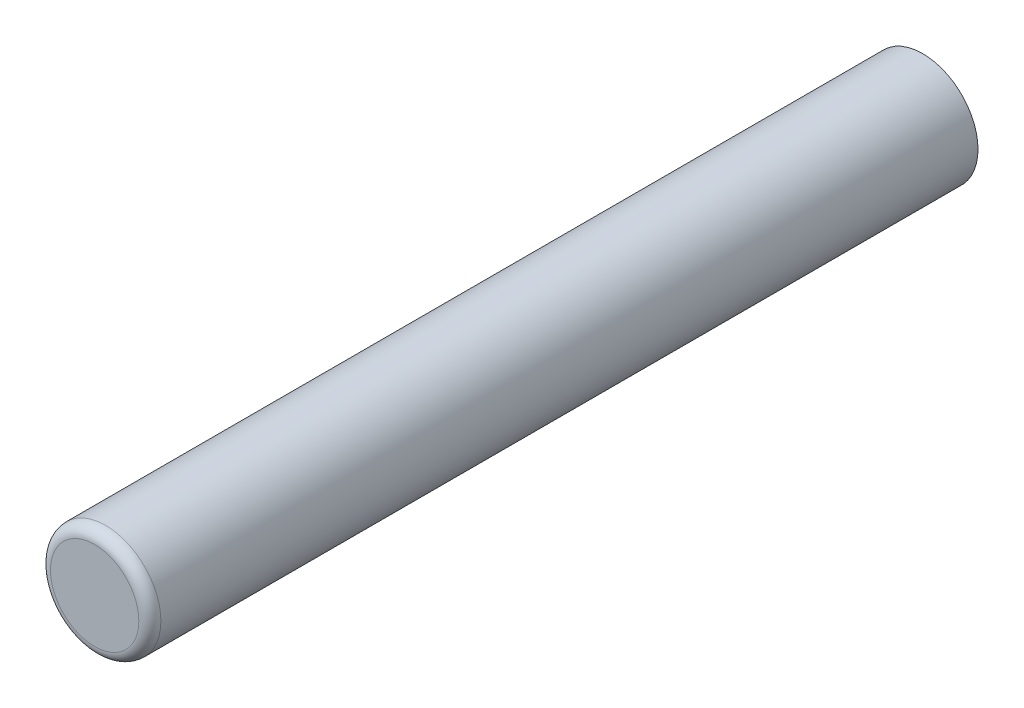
ISO-10303-21;
HEADER;
FILE_DESCRIPTION(('STEP AP214'),'2;1');
FILE_NAME('part.step','',(''),(''),'','','');
FILE_SCHEMA(('AUTOMOTIVE_DESIGN { 1 0 10303 214 1 1 1 1 }'));
ENDSEC;
DATA;
#1=APPLICATION_CONTEXT('core data for automotive mechanical design processes');
#2=APPLICATION_PROTOCOL_DEFINITION('international standard','automotive_design',2000,#1);
#3=PRODUCT_CONTEXT('',#1,'mechanical');
#4=PRODUCT('Part','Part','',(#3));
#5=PRODUCT_RELATED_PRODUCT_CATEGORY('part','',(#4));
#6=PRODUCT_DEFINITION_FORMATION('','',#4);
#7=PRODUCT_DEFINITION_CONTEXT('part definition',#1,'design');
#8=PRODUCT_DEFINITION('design','',#6,#7);
#9=PRODUCT_DEFINITION_SHAPE('','',#8);
#10=(LENGTH_UNIT() NAMED_UNIT(*) SI_UNIT(.MILLI.,.METRE.));
#11=(NAMED_UNIT(*) PLANE_ANGLE_UNIT() SI_UNIT($,.RADIAN.));
#12=(NAMED_UNIT(*) SI_UNIT($,.STERADIAN.) SOLID_ANGLE_UNIT());
#13=UNCERTAINTY_MEASURE_WITH_UNIT(LENGTH_MEASURE(1.E-05),#10,'distance_accuracy_value','');
#14=(GEOMETRIC_REPRESENTATION_CONTEXT(3) GLOBAL_UNCERTAINTY_ASSIGNED_CONTEXT((#13)) GLOBAL_UNIT_ASSIGNED_CONTEXT((#10,
#11,#12)) REPRESENTATION_CONTEXT('',''));
#15=CARTESIAN_POINT('',(0.,0.,0.));
#16=DIRECTION('',(0.,0.,1.));
#17=DIRECTION('',(1.,0.,0.));
#18=AXIS2_PLACEMENT_3D('',#15,#16,#17);
#19=CARTESIAN_POINT('',(0.,0.,7.62));
#20=DIRECTION('',(0.,0.,-1.));
#21=DIRECTION('',(-1.,0.,0.));
#22=AXIS2_PLACEMENT_3D('',#19,#20,#21);
#23=CYLINDRICAL_SURFACE('',#22,0.508);
#24=CARTESIAN_POINT('',(0.,0.,7.5184));
#25=DIRECTION('',(0.,0.,1.));
#26=DIRECTION('',(1.,0.,0.));
#27=AXIS2_PLACEMENT_3D('',#24,#25,#26);
#28=CIRCLE('',#27,0.508);
#29=CARTESIAN_POINT('',(0.508,0.,7.5184));
#30=VERTEX_POINT('',#29);
#31=EDGE_CURVE('E11',#30,#30,#28,.F.);
#32=ORIENTED_EDGE('',*,*,#31,.T.);
#33=EDGE_LOOP('',(#32));
#34=FACE_BOUND('',#33,.T.);
#35=CARTESIAN_POINT('',(0.,0.,0.));
#36=DIRECTION('',(0.,0.,1.));
#37=DIRECTION('',(1.,0.,0.));
#38=AXIS2_PLACEMENT_3D('',#35,#36,#37);
#39=CIRCLE('',#38,0.508);
#40=CARTESIAN_POINT('',(0.508,0.,0.));
#41=VERTEX_POINT('',#40);
#42=EDGE_CURVE('E43',#41,#41,#39,.T.);
#43=ORIENTED_EDGE('',*,*,#42,.T.);
#44=EDGE_LOOP('',(#43));
#45=FACE_BOUND('',#44,.T.);
#46=ADVANCED_FACE('F32',(#34,#45),#23,.T.);
#47=CARTESIAN_POINT('',(0.,0.,7.62));
#48=DIRECTION('',(0.,0.,1.));
#49=DIRECTION('',(1.,0.,0.));
#50=AXIS2_PLACEMENT_3D('',#47,#48,#49);
#51=PLANE('',#50);
#52=CARTESIAN_POINT('',(0.,0.,7.62));
#53=DIRECTION('',(0.,0.,1.));
#54=DIRECTION('',(1.,0.,0.));
#55=AXIS2_PLACEMENT_3D('',#52,#53,#54);
#56=CIRCLE('',#55,0.4064);
#57=CARTESIAN_POINT('',(0.4064,0.,7.62));
#58=VERTEX_POINT('',#57);
#59=EDGE_CURVE('E39',#58,#58,#56,.T.);
#60=ORIENTED_EDGE('',*,*,#59,.T.);
#61=EDGE_LOOP('',(#60));
#62=FACE_BOUND('',#61,.T.);
#63=ADVANCED_FACE('F53',(#62),#51,.T.);
#64=CARTESIAN_POINT('',(0.,0.,0.));
#65=DIRECTION('',(0.,0.,1.));
#66=DIRECTION('',(1.,0.,0.));
#67=AXIS2_PLACEMENT_3D('',#64,#65,#66);
#68=PLANE('',#67);
#69=ORIENTED_EDGE('',*,*,#42,.F.);
#70=EDGE_LOOP('',(#69));
#71=FACE_BOUND('',#70,.T.);
#72=ADVANCED_FACE('F51',(#71),#68,.F.);
#73=CARTESIAN_POINT('',(0.,0.,7.5184));
#74=DIRECTION('',(0.,0.,1.));
#75=DIRECTION('',(1.,0.,0.));
#76=AXIS2_PLACEMENT_3D('',#73,#74,#75);
#77=TOROIDAL_SURFACE('',#76,0.4064,0.1016);
#78=ORIENTED_EDGE('',*,*,#31,.F.);
#79=EDGE_LOOP('',(#78));
#80=FACE_BOUND('',#79,.T.);
#81=ORIENTED_EDGE('',*,*,#59,.F.);
#82=EDGE_LOOP('',(#81));
#83=FACE_BOUND('',#82,.T.);
#84=ADVANCED_FACE('F34',(#80,#83),#77,.T.);
#85=CLOSED_SHELL('',(#46,#63,#72,#84));
#86=MANIFOLD_SOLID_BREP('B2',#85);
#87=ADVANCED_BREP_SHAPE_REPRESENTATION('',(#18,#86),#14);
#88=SHAPE_DEFINITION_REPRESENTATION(#9,#87);
ENDSEC;
END-ISO-10303-21;
